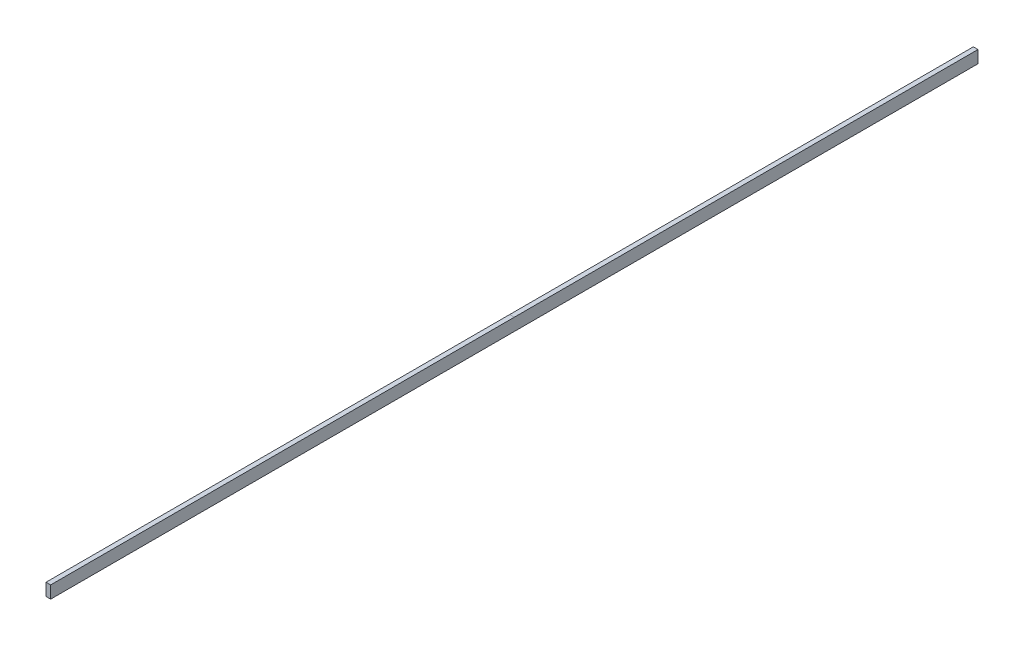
from build123d import *

# Parameters (mm, degrees)
CROQUIS1_W     = 30
CROQUIS1_H     = 80
EXTRUIR1_DEPTH = 3000
CROQUIS2_W     = 30
CROQUIS2_H     = 80
EXTRUIR2_DEPTH = 3000


with BuildPart() as part:
    # Croquis1 → Extruir1 (new body)
    with BuildSketch(Plane.XY):
        Rectangle(CROQUIS1_W, CROQUIS1_H)
    extrude(amount=EXTRUIR1_DEPTH)

    # Croquis2 → Extruir2 (add)
    with BuildSketch(Plane.XY.offset(3000)):
        Rectangle(CROQUIS2_W, CROQUIS2_H)
    extrude(amount=EXTRUIR2_DEPTH)


solid = part.part
